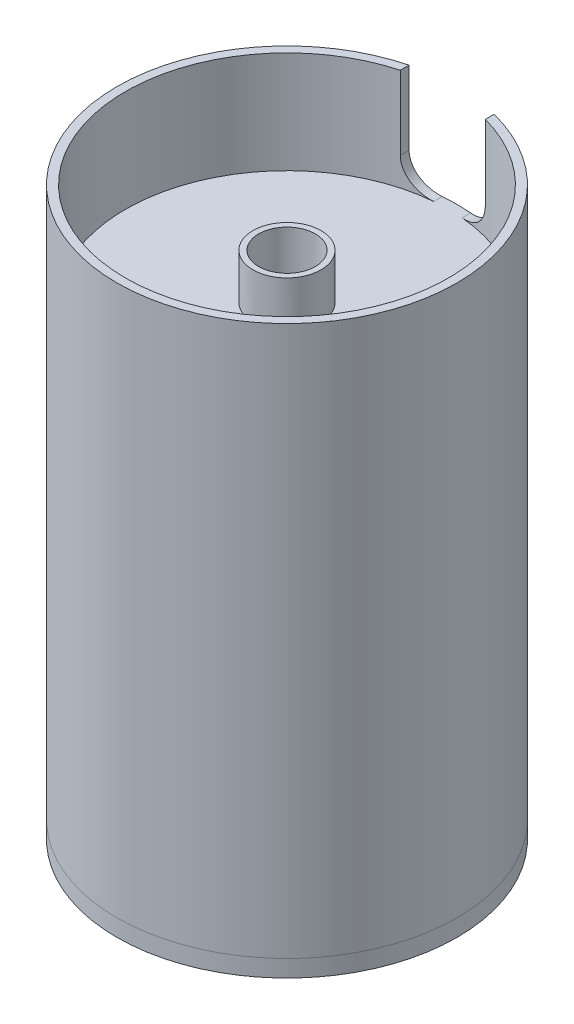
from build123d import *

# Parameters (mm, degrees)
CROQUIS1_R              = 30
SALIENTE_EXTRUIR1_DEPTH = 97
VACIADO1_T              = -1.5
CROQUIS3_R              = 25
CROQUIS3_R_2            = 18
SALIENTE_EXTRUIR2_DEPTH = 3
CROQUIS4_R              = 18
SALIENTE_EXTRUIR3_DEPTH = 1
CORTAR_EXTRUIR1_DEPTH   = 40
CORTAR_EXTRUIR2_START   = 48
CROQUIS9_R              = 28.5
CORTAR_EXTRUIR2_DEPTH   = 48
CROQUIS7_R              = 28.5
SALIENTE_EXTRUIR5_DEPTH = 3
CROQUIS8_R              = 6
CROQUIS8_R_2            = 5
SALIENTE_EXTRUIR6_DEPTH = 8


with BuildPart() as part:
    # Croquis1 → Saliente-Extruir1 (new body)
    with BuildSketch(Plane(origin=(0, 0, 0), x_dir=(1, 0, 0), z_dir=(0, 1, 0))):
        with Locations(Location((0, 0, 0), (0, 0, 270))):
            Circle(CROQUIS1_R)
    extrude(amount=-SALIENTE_EXTRUIR1_DEPTH)

    # Vaciado1
    vaciado1_openings = [part.faces().sort_by_distance(p)[0] for p in [
        (0, -97, 0),
    ]]
    offset(amount=VACIADO1_T, openings=vaciado1_openings, kind=Kind.INTERSECTION)

    # Croquis6 → Cortar-Extruir1 (cut)
    with BuildSketch(Plane.XY):
        with BuildLine():
            Line((-2.5, -18), (2.5, -18))
            ThreePointArc((2.5, -18), (6.035533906, -16.535533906), (7.5, -13))
            Line((7.5, -13), (7.5, 34.733406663))
            Line((7.5, 34.733406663), (-7.5, 34.733406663))
            Line((-7.5, 34.733406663), (-7.5, -13))
            ThreePointArc((-7.5, -13), (-6.035533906, -16.535533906), (-2.5, -18))
        make_face()
    extrude(amount=-CORTAR_EXTRUIR1_DEPTH, mode=Mode.SUBTRACT)

    # Croquis9 → Cortar-Extruir2 (cut)
    with BuildSketch(Plane(origin=(0, -18, 0), x_dir=(1, 0, 0), z_dir=(0, 1, 0)).offset(CORTAR_EXTRUIR2_START)):
        with Locations(Location((0, 0, 0), (0, 0, 270))):
            Circle(CROQUIS9_R)
    extrude(amount=-CORTAR_EXTRUIR2_DEPTH, mode=Mode.SUBTRACT)

    # Croquis7 → Saliente-Extruir5 (add)
    with BuildSketch(Plane(origin=(0, -18, 0), x_dir=(1, 0, 0), z_dir=(0, 1, 0))):
        with Locations(Location((0, 0, 0), (0, 0, 270))):
            Circle(CROQUIS7_R)
    extrude(amount=-SALIENTE_EXTRUIR5_DEPTH)

    # Croquis8 → Saliente-Extruir6 (add)
    with BuildSketch(Plane(origin=(0, -18, 0), x_dir=(1, 0, 0), z_dir=(0, 1, 0))):
        with Locations(Location((0, 0, 0), (0, 0, 90))):
            Circle(CROQUIS8_R)
        with Locations(Location((0, 0, 0), (0, 0, 270))):
            Circle(CROQUIS8_R_2, mode=Mode.SUBTRACT)
    extrude(amount=SALIENTE_EXTRUIR6_DEPTH)


with BuildPart() as body_2:
    # Croquis2 → Revoluci_n1 (revolve)
    with BuildSketch(Plane.XY):
        Polygon((-20, -94), (-28.535323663, -94), (-28.535323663, -97), (-30, -97), (-30, -100), (-26, -100), align=None)
    revolve(axis=Axis((0, -89.140472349, 0), (0, -1, 0)))


with BuildPart() as body_3:
    # Croquis3 → Saliente-Extruir2 (new body)
    with BuildSketch(Plane(origin=(0, -94, 0), x_dir=(1, 0, 0), z_dir=(0, 1, 0))):
        with Locations(Location((0, 0, 0), (0, 0, 180))):
            Circle(CROQUIS3_R)
        with Locations(Location((0, 0, 0), (0, 0, 180))):
            Circle(CROQUIS3_R_2, mode=Mode.SUBTRACT)
    extrude(amount=SALIENTE_EXTRUIR2_DEPTH)


with BuildPart() as body_4:
    # Croquis4 → Saliente-Extruir3 (new body)
    with BuildSketch(Plane.XZ.offset(94)):
        Circle(CROQUIS4_R)
    extrude(amount=-SALIENTE_EXTRUIR3_DEPTH)


solid = Compound([part.part, body_2.part, body_3.part, body_4.part])
